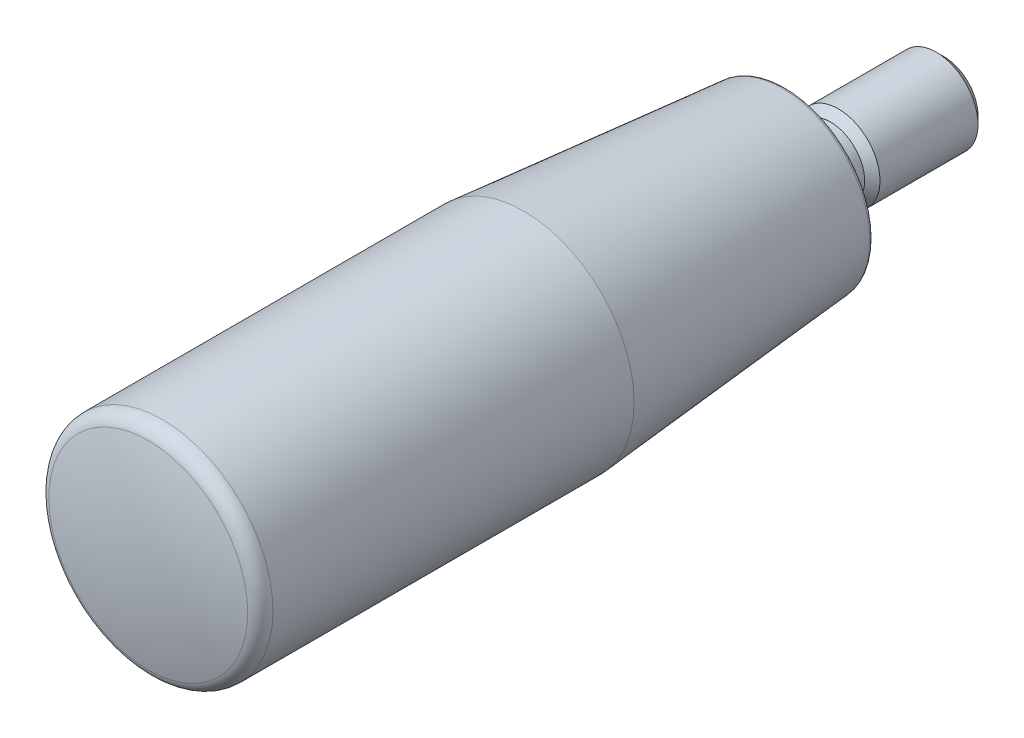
ISO-10303-21;
HEADER;
FILE_DESCRIPTION(('STEP AP214'),'2;1');
FILE_NAME('part.step','',(''),(''),'','','');
FILE_SCHEMA(('AUTOMOTIVE_DESIGN { 1 0 10303 214 1 1 1 1 }'));
ENDSEC;
DATA;
#1=APPLICATION_CONTEXT('core data for automotive mechanical design processes');
#2=APPLICATION_PROTOCOL_DEFINITION('international standard','automotive_design',2000,#1);
#3=PRODUCT_CONTEXT('',#1,'mechanical');
#4=PRODUCT('Part','Part','',(#3));
#5=PRODUCT_RELATED_PRODUCT_CATEGORY('part','',(#4));
#6=PRODUCT_DEFINITION_FORMATION('','',#4);
#7=PRODUCT_DEFINITION_CONTEXT('part definition',#1,'design');
#8=PRODUCT_DEFINITION('design','',#6,#7);
#9=PRODUCT_DEFINITION_SHAPE('','',#8);
#10=(LENGTH_UNIT() NAMED_UNIT(*) SI_UNIT(.MILLI.,.METRE.));
#11=(NAMED_UNIT(*) PLANE_ANGLE_UNIT() SI_UNIT($,.RADIAN.));
#12=(NAMED_UNIT(*) SI_UNIT($,.STERADIAN.) SOLID_ANGLE_UNIT());
#13=UNCERTAINTY_MEASURE_WITH_UNIT(LENGTH_MEASURE(1.E-05),#10,'distance_accuracy_value','');
#14=(GEOMETRIC_REPRESENTATION_CONTEXT(3) GLOBAL_UNCERTAINTY_ASSIGNED_CONTEXT((#13)) GLOBAL_UNIT_ASSIGNED_CONTEXT((#10,
#11,#12)) REPRESENTATION_CONTEXT('',''));
#15=CARTESIAN_POINT('',(0.,0.,0.));
#16=DIRECTION('',(0.,0.,1.));
#17=DIRECTION('',(1.,0.,0.));
#18=AXIS2_PLACEMENT_3D('',#15,#16,#17);
#19=CARTESIAN_POINT('',(0.,0.,-17.));
#20=DIRECTION('',(0.,0.,1.));
#21=DIRECTION('',(1.,0.,0.));
#22=AXIS2_PLACEMENT_3D('',#19,#20,#21);
#23=PLANE('',#22);
#24=CARTESIAN_POINT('',(0.,0.,-17.));
#25=DIRECTION('',(0.,0.,1.));
#26=DIRECTION('',(1.,0.,0.));
#27=AXIS2_PLACEMENT_3D('',#24,#25,#26);
#28=CIRCLE('',#27,4.08);
#29=CARTESIAN_POINT('',(4.08,0.,-17.));
#30=VERTEX_POINT('',#29);
#31=EDGE_CURVE('E130',#30,#30,#28,.T.);
#32=ORIENTED_EDGE('',*,*,#31,.F.);
#33=EDGE_LOOP('',(#32));
#34=FACE_BOUND('',#33,.T.);
#35=DIRECTION('',(-0.866025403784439,-0.5,0.));
#36=VECTOR('',#35,1.);
#37=CARTESIAN_POINT('',(1.25,-2.1650635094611,-17.));
#38=LINE('',#37,#36);
#39=CARTESIAN_POINT('',(2.5,-1.44337567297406,-17.));
#40=VERTEX_POINT('',#39);
#41=CARTESIAN_POINT('',(0.,-2.88675134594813,-17.));
#42=VERTEX_POINT('',#41);
#43=EDGE_CURVE('E9',#40,#42,#38,.T.);
#44=ORIENTED_EDGE('',*,*,#43,.F.);
#45=DIRECTION('',(0.,-1.,0.));
#46=VECTOR('',#45,1.);
#47=CARTESIAN_POINT('',(2.5,0.,-17.));
#48=LINE('',#47,#46);
#49=CARTESIAN_POINT('',(2.5,1.44337567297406,-17.));
#50=VERTEX_POINT('',#49);
#51=EDGE_CURVE('E78',#50,#40,#48,.T.);
#52=ORIENTED_EDGE('',*,*,#51,.F.);
#53=DIRECTION('',(0.866025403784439,-0.5,0.));
#54=VECTOR('',#53,1.);
#55=CARTESIAN_POINT('',(1.25,2.1650635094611,-17.));
#56=LINE('',#55,#54);
#57=CARTESIAN_POINT('',(0.,2.88675134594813,-17.));
#58=VERTEX_POINT('',#57);
#59=EDGE_CURVE('E134',#58,#50,#56,.T.);
#60=ORIENTED_EDGE('',*,*,#59,.F.);
#61=DIRECTION('',(0.866025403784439,0.5,0.));
#62=VECTOR('',#61,1.);
#63=CARTESIAN_POINT('',(-1.25,2.1650635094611,-17.));
#64=LINE('',#63,#62);
#65=CARTESIAN_POINT('',(-2.5,1.44337567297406,-17.));
#66=VERTEX_POINT('',#65);
#67=EDGE_CURVE('E136',#66,#58,#64,.T.);
#68=ORIENTED_EDGE('',*,*,#67,.F.);
#69=DIRECTION('',(0.,1.,0.));
#70=VECTOR('',#69,1.);
#71=CARTESIAN_POINT('',(-2.5,0.,-17.));
#72=LINE('',#71,#70);
#73=CARTESIAN_POINT('',(-2.5,-1.44337567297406,-17.));
#74=VERTEX_POINT('',#73);
#75=EDGE_CURVE('E138',#74,#66,#72,.T.);
#76=ORIENTED_EDGE('',*,*,#75,.F.);
#77=DIRECTION('',(-0.866025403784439,0.5,0.));
#78=VECTOR('',#77,1.);
#79=CARTESIAN_POINT('',(-1.25,-2.1650635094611,-17.));
#80=LINE('',#79,#78);
#81=EDGE_CURVE('E21',#42,#74,#80,.T.);
#82=ORIENTED_EDGE('',*,*,#81,.F.);
#83=EDGE_LOOP('',(#44,#52,#60,#68,#76,#82));
#84=FACE_BOUND('',#83,.T.);
#85=ADVANCED_FACE('F14',(#34,#84),#23,.F.);
#86=CARTESIAN_POINT('',(0.,0.,-17.));
#87=DIRECTION('',(0.,0.,1.));
#88=DIRECTION('',(1.,0.,0.));
#89=AXIS2_PLACEMENT_3D('',#86,#87,#88);
#90=CONICAL_SURFACE('',#89,4.08,0.785398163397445);
#91=CARTESIAN_POINT('',(0.,0.,-16.08));
#92=DIRECTION('',(0.,0.,1.));
#93=DIRECTION('',(1.,0.,0.));
#94=AXIS2_PLACEMENT_3D('',#91,#92,#93);
#95=CIRCLE('',#94,5.);
#96=CARTESIAN_POINT('',(5.,0.,-16.08));
#97=VERTEX_POINT('',#96);
#98=EDGE_CURVE('E127',#97,#97,#95,.T.);
#99=ORIENTED_EDGE('',*,*,#98,.F.);
#100=EDGE_LOOP('',(#99));
#101=FACE_BOUND('',#100,.T.);
#102=ORIENTED_EDGE('',*,*,#31,.T.);
#103=EDGE_LOOP('',(#102));
#104=FACE_BOUND('',#103,.T.);
#105=ADVANCED_FACE('F171',(#101,#104),#90,.T.);
#106=CARTESIAN_POINT('',(0.,0.,80.));
#107=DIRECTION('',(0.,0.,1.));
#108=DIRECTION('',(1.,0.,0.));
#109=AXIS2_PLACEMENT_3D('',#106,#107,#108);
#110=CYLINDRICAL_SURFACE('',#109,5.);
#111=CARTESIAN_POINT('',(0.,0.,-4.32));
#112=DIRECTION('',(0.,0.,1.));
#113=DIRECTION('',(1.,0.,0.));
#114=AXIS2_PLACEMENT_3D('',#111,#112,#113);
#115=CIRCLE('',#114,5.);
#116=CARTESIAN_POINT('',(5.,0.,-4.32));
#117=VERTEX_POINT('',#116);
#118=EDGE_CURVE('E124',#117,#117,#115,.T.);
#119=ORIENTED_EDGE('',*,*,#118,.F.);
#120=EDGE_LOOP('',(#119));
#121=FACE_BOUND('',#120,.T.);
#122=ORIENTED_EDGE('',*,*,#98,.T.);
#123=EDGE_LOOP('',(#122));
#124=FACE_BOUND('',#123,.T.);
#125=ADVANCED_FACE('F176',(#121,#124),#110,.T.);
#126=CARTESIAN_POINT('',(0.,0.,-4.32));
#127=DIRECTION('',(0.,0.,-1.));
#128=DIRECTION('',(-1.,0.,0.));
#129=AXIS2_PLACEMENT_3D('',#126,#127,#128);
#130=CONICAL_SURFACE('',#129,5.,0.785398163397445);
#131=CARTESIAN_POINT('',(0.,0.,-3.4));
#132=DIRECTION('',(0.,0.,1.));
#133=DIRECTION('',(1.,0.,0.));
#134=AXIS2_PLACEMENT_3D('',#131,#132,#133);
#135=CIRCLE('',#134,4.08);
#136=CARTESIAN_POINT('',(4.08,0.,-3.4));
#137=VERTEX_POINT('',#136);
#138=EDGE_CURVE('E121',#137,#137,#135,.T.);
#139=ORIENTED_EDGE('',*,*,#138,.F.);
#140=EDGE_LOOP('',(#139));
#141=FACE_BOUND('',#140,.T.);
#142=ORIENTED_EDGE('',*,*,#118,.T.);
#143=EDGE_LOOP('',(#142));
#144=FACE_BOUND('',#143,.T.);
#145=ADVANCED_FACE('F183',(#141,#144),#130,.T.);
#146=CARTESIAN_POINT('',(0.,0.,80.));
#147=DIRECTION('',(0.,0.,1.));
#148=DIRECTION('',(1.,0.,0.));
#149=AXIS2_PLACEMENT_3D('',#146,#147,#148);
#150=CYLINDRICAL_SURFACE('',#149,4.08);
#151=CARTESIAN_POINT('',(0.,0.,0.));
#152=DIRECTION('',(0.,0.,1.));
#153=DIRECTION('',(1.,0.,0.));
#154=AXIS2_PLACEMENT_3D('',#151,#152,#153);
#155=CIRCLE('',#154,4.08);
#156=CARTESIAN_POINT('',(4.08,0.,0.));
#157=VERTEX_POINT('',#156);
#158=EDGE_CURVE('E118',#157,#157,#155,.T.);
#159=ORIENTED_EDGE('',*,*,#158,.F.);
#160=EDGE_LOOP('',(#159));
#161=FACE_BOUND('',#160,.T.);
#162=ORIENTED_EDGE('',*,*,#138,.T.);
#163=EDGE_LOOP('',(#162));
#164=FACE_BOUND('',#163,.T.);
#165=ADVANCED_FACE('F190',(#161,#164),#150,.T.);
#166=CARTESIAN_POINT('',(0.,4.08,0.));
#167=DIRECTION('',(0.,0.,1.));
#168=DIRECTION('',(1.,0.,0.));
#169=AXIS2_PLACEMENT_3D('',#166,#167,#168);
#170=PLANE('',#169);
#171=CARTESIAN_POINT('',(0.,0.,0.));
#172=DIRECTION('',(0.,0.,1.));
#173=DIRECTION('',(1.,0.,0.));
#174=AXIS2_PLACEMENT_3D('',#171,#172,#173);
#175=CIRCLE('',#174,6.);
#176=CARTESIAN_POINT('',(6.,0.,0.));
#177=VERTEX_POINT('',#176);
#178=EDGE_CURVE('E115',#177,#177,#175,.T.);
#179=ORIENTED_EDGE('',*,*,#178,.F.);
#180=EDGE_LOOP('',(#179));
#181=FACE_BOUND('',#180,.T.);
#182=ORIENTED_EDGE('',*,*,#158,.T.);
#183=EDGE_LOOP('',(#182));
#184=FACE_BOUND('',#183,.T.);
#185=ADVANCED_FACE('F194',(#181,#184),#170,.F.);
#186=CARTESIAN_POINT('',(0.,0.,80.));
#187=DIRECTION('',(0.,0.,1.));
#188=DIRECTION('',(1.,0.,0.));
#189=AXIS2_PLACEMENT_3D('',#186,#187,#188);
#190=CYLINDRICAL_SURFACE('',#189,6.);
#191=CARTESIAN_POINT('',(0.,0.,2.));
#192=DIRECTION('',(0.,0.,1.));
#193=DIRECTION('',(1.,0.,0.));
#194=AXIS2_PLACEMENT_3D('',#191,#192,#193);
#195=CIRCLE('',#194,6.);
#196=CARTESIAN_POINT('',(6.,0.,2.));
#197=VERTEX_POINT('',#196);
#198=EDGE_CURVE('E112',#197,#197,#195,.T.);
#199=ORIENTED_EDGE('',*,*,#198,.F.);
#200=EDGE_LOOP('',(#199));
#201=FACE_BOUND('',#200,.T.);
#202=ORIENTED_EDGE('',*,*,#178,.T.);
#203=EDGE_LOOP('',(#202));
#204=FACE_BOUND('',#203,.T.);
#205=ADVANCED_FACE('F198',(#201,#204),#190,.T.);
#206=CARTESIAN_POINT('',(0.,6.,2.));
#207=DIRECTION('',(0.,0.,1.));
#208=DIRECTION('',(1.,0.,0.));
#209=AXIS2_PLACEMENT_3D('',#206,#207,#208);
#210=PLANE('',#209);
#211=CARTESIAN_POINT('',(0.,0.,2.));
#212=DIRECTION('',(0.,0.,1.));
#213=DIRECTION('',(1.,0.,0.));
#214=AXIS2_PLACEMENT_3D('',#211,#212,#213);
#215=CIRCLE('',#214,10.0418344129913);
#216=CARTESIAN_POINT('',(10.0418344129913,0.,2.));
#217=VERTEX_POINT('',#216);
#218=EDGE_CURVE('E109',#217,#217,#215,.T.);
#219=ORIENTED_EDGE('',*,*,#218,.F.);
#220=EDGE_LOOP('',(#219));
#221=FACE_BOUND('',#220,.T.);
#222=ORIENTED_EDGE('',*,*,#198,.T.);
#223=EDGE_LOOP('',(#222));
#224=FACE_BOUND('',#223,.T.);
#225=ADVANCED_FACE('F202',(#221,#224),#210,.F.);
#226=CARTESIAN_POINT('',(0.,0.,2.5));
#227=DIRECTION('',(0.,0.,1.));
#228=DIRECTION('',(1.,0.,0.));
#229=AXIS2_PLACEMENT_3D('',#226,#227,#228);
#230=TOROIDAL_SURFACE('',#229,10.0418344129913,0.5);
#231=ORIENTED_EDGE('',*,*,#218,.T.);
#232=EDGE_LOOP('',(#231));
#233=FACE_BOUND('',#232,.T.);
#234=CARTESIAN_POINT('',(0.,0.,2.45642212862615));
#235=DIRECTION('',(0.,0.,1.));
#236=DIRECTION('',(1.,0.,0.));
#237=AXIS2_PLACEMENT_3D('',#234,#235,#236);
#238=CIRCLE('',#237,10.5399317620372);
#239=CARTESIAN_POINT('',(10.5399317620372,0.,2.45642212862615));
#240=VERTEX_POINT('',#239);
#241=EDGE_CURVE('E106',#240,#240,#238,.T.);
#242=ORIENTED_EDGE('',*,*,#241,.F.);
#243=EDGE_LOOP('',(#242));
#244=FACE_BOUND('',#243,.T.);
#245=ADVANCED_FACE('F206',(#233,#244),#230,.T.);
#246=CARTESIAN_POINT('',(0.,0.,2.45642212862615));
#247=DIRECTION('',(0.,0.,1.));
#248=DIRECTION('',(1.,0.,0.));
#249=AXIS2_PLACEMENT_3D('',#246,#247,#248);
#250=CONICAL_SURFACE('',#249,10.5399317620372,0.0872664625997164);
#251=CARTESIAN_POINT('',(0.,0.,33.4326438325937));
#252=DIRECTION('',(0.,0.,1.));
#253=DIRECTION('',(1.,0.,0.));
#254=AXIS2_PLACEMENT_3D('',#251,#252,#253);
#255=CIRCLE('',#254,13.25);
#256=CARTESIAN_POINT('',(13.25,0.,33.4326438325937));
#257=VERTEX_POINT('',#256);
#258=EDGE_CURVE('E103',#257,#257,#255,.T.);
#259=ORIENTED_EDGE('',*,*,#258,.F.);
#260=EDGE_LOOP('',(#259));
#261=FACE_BOUND('',#260,.T.);
#262=ORIENTED_EDGE('',*,*,#241,.T.);
#263=EDGE_LOOP('',(#262));
#264=FACE_BOUND('',#263,.T.);
#265=ADVANCED_FACE('F210',(#261,#264),#250,.T.);
#266=CARTESIAN_POINT('',(0.,0.,80.));
#267=DIRECTION('',(0.,0.,1.));
#268=DIRECTION('',(1.,0.,0.));
#269=AXIS2_PLACEMENT_3D('',#266,#267,#268);
#270=CYLINDRICAL_SURFACE('',#269,13.25);
#271=CARTESIAN_POINT('',(0.,0.,76.7622349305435));
#272=DIRECTION('',(0.,0.,1.));
#273=DIRECTION('',(1.,0.,0.));
#274=AXIS2_PLACEMENT_3D('',#271,#272,#273);
#275=CIRCLE('',#274,13.25);
#276=CARTESIAN_POINT('',(13.25,0.,76.7622349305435));
#277=VERTEX_POINT('',#276);
#278=EDGE_CURVE('E100',#277,#277,#275,.T.);
#279=ORIENTED_EDGE('',*,*,#278,.F.);
#280=EDGE_LOOP('',(#279));
#281=FACE_BOUND('',#280,.T.);
#282=ORIENTED_EDGE('',*,*,#258,.T.);
#283=EDGE_LOOP('',(#282));
#284=FACE_BOUND('',#283,.T.);
#285=ADVANCED_FACE('F214',(#281,#284),#270,.T.);
#286=CARTESIAN_POINT('',(0.,0.,76.7622349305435));
#287=DIRECTION('',(0.,0.,1.));
#288=DIRECTION('',(1.,0.,0.));
#289=AXIS2_PLACEMENT_3D('',#286,#287,#288);
#290=TOROIDAL_SURFACE('',#289,11.4833333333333,1.76666666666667);
#291=ORIENTED_EDGE('',*,*,#278,.T.);
#292=EDGE_LOOP('',(#291));
#293=FACE_BOUND('',#292,.T.);
#294=CARTESIAN_POINT('',(0.,0.,78.4718507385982));
#295=DIRECTION('',(0.,0.,1.));
#296=DIRECTION('',(1.,0.,0.));
#297=AXIS2_PLACEMENT_3D('',#294,#295,#296);
#298=CIRCLE('',#297,11.9286701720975);
#299=CARTESIAN_POINT('',(11.9286701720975,0.,78.4718507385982));
#300=VERTEX_POINT('',#299);
#301=EDGE_CURVE('E97',#300,#300,#298,.T.);
#302=ORIENTED_EDGE('',*,*,#301,.F.);
#303=EDGE_LOOP('',(#302));
#304=FACE_BOUND('',#303,.T.);
#305=ADVANCED_FACE('F218',(#293,#304),#290,.T.);
#306=CARTESIAN_POINT('',(0.,1.16226472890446E-13,32.678571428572));
#307=DIRECTION('',(0.,0.,1.));
#308=DIRECTION('',(0.,-1.,0.));
#309=AXIS2_PLACEMENT_3D('',#306,#307,#308);
#310=SPHERICAL_SURFACE('',#309,47.321428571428);
#311=ORIENTED_EDGE('',*,*,#301,.T.);
#312=EDGE_LOOP('',(#311));
#313=FACE_BOUND('',#312,.T.);
#314=ADVANCED_FACE('F222',(#313),#310,.T.);
#315=CARTESIAN_POINT('',(2.5,-1.44337567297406,-22.));
#316=DIRECTION('',(-0.5,0.866025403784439,0.));
#317=DIRECTION('',(-0.866025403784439,-0.5,0.));
#318=AXIS2_PLACEMENT_3D('',#315,#316,#317);
#319=PLANE('',#318);
#320=ORIENTED_EDGE('',*,*,#43,.T.);
#321=DIRECTION('',(0.,0.,1.));
#322=VECTOR('',#321,1.);
#323=CARTESIAN_POINT('',(0.,-2.88675134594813,-22.));
#324=LINE('',#323,#322);
#325=CARTESIAN_POINT('',(0.,-2.88675134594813,-12.));
#326=VERTEX_POINT('',#325);
#327=EDGE_CURVE('E67',#42,#326,#324,.T.);
#328=ORIENTED_EDGE('',*,*,#327,.T.);
#329=DIRECTION('',(-0.866025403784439,-0.5,0.));
#330=VECTOR('',#329,1.);
#331=CARTESIAN_POINT('',(2.5,-1.44337567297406,-12.));
#332=LINE('',#331,#330);
#333=CARTESIAN_POINT('',(2.5,-1.44337567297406,-12.));
#334=VERTEX_POINT('',#333);
#335=EDGE_CURVE('E63',#334,#326,#332,.T.);
#336=ORIENTED_EDGE('',*,*,#335,.F.);
#337=DIRECTION('',(0.,0.,1.));
#338=VECTOR('',#337,1.);
#339=CARTESIAN_POINT('',(2.5,-1.44337567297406,-22.));
#340=LINE('',#339,#338);
#341=EDGE_CURVE('E66',#40,#334,#340,.T.);
#342=ORIENTED_EDGE('',*,*,#341,.F.);
#343=EDGE_LOOP('',(#320,#328,#336,#342));
#344=FACE_BOUND('',#343,.T.);
#345=ADVANCED_FACE('F65',(#344),#319,.T.);
#346=CARTESIAN_POINT('',(0.,-2.88675134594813,-22.));
#347=DIRECTION('',(0.5,0.866025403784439,0.));
#348=DIRECTION('',(-0.866025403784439,0.5,0.));
#349=AXIS2_PLACEMENT_3D('',#346,#347,#348);
#350=PLANE('',#349);
#351=ORIENTED_EDGE('',*,*,#81,.T.);
#352=DIRECTION('',(0.,0.,1.));
#353=VECTOR('',#352,1.);
#354=CARTESIAN_POINT('',(-2.5,-1.44337567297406,-22.));
#355=LINE('',#354,#353);
#356=CARTESIAN_POINT('',(-2.5,-1.44337567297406,-12.));
#357=VERTEX_POINT('',#356);
#358=EDGE_CURVE('E94',#74,#357,#355,.T.);
#359=ORIENTED_EDGE('',*,*,#358,.T.);
#360=DIRECTION('',(-0.866025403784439,0.5,0.));
#361=VECTOR('',#360,1.);
#362=CARTESIAN_POINT('',(0.,-2.88675134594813,-12.));
#363=LINE('',#362,#361);
#364=EDGE_CURVE('E72',#326,#357,#363,.T.);
#365=ORIENTED_EDGE('',*,*,#364,.F.);
#366=ORIENTED_EDGE('',*,*,#327,.F.);
#367=EDGE_LOOP('',(#351,#359,#365,#366));
#368=FACE_BOUND('',#367,.T.);
#369=ADVANCED_FACE('F142',(#368),#350,.T.);
#370=CARTESIAN_POINT('',(-2.5,-1.44337567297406,-22.));
#371=DIRECTION('',(1.,0.,0.));
#372=DIRECTION('',(0.,0.,-1.));
#373=AXIS2_PLACEMENT_3D('',#370,#371,#372);
#374=PLANE('',#373);
#375=ORIENTED_EDGE('',*,*,#75,.T.);
#376=DIRECTION('',(0.,0.,1.));
#377=VECTOR('',#376,1.);
#378=CARTESIAN_POINT('',(-2.5,1.44337567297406,-22.));
#379=LINE('',#378,#377);
#380=CARTESIAN_POINT('',(-2.5,1.44337567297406,-12.));
#381=VERTEX_POINT('',#380);
#382=EDGE_CURVE('E92',#66,#381,#379,.T.);
#383=ORIENTED_EDGE('',*,*,#382,.T.);
#384=DIRECTION('',(0.,1.,0.));
#385=VECTOR('',#384,1.);
#386=CARTESIAN_POINT('',(-2.5,-1.44337567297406,-12.));
#387=LINE('',#386,#385);
#388=EDGE_CURVE('E150',#357,#381,#387,.T.);
#389=ORIENTED_EDGE('',*,*,#388,.F.);
#390=ORIENTED_EDGE('',*,*,#358,.F.);
#391=EDGE_LOOP('',(#375,#383,#389,#390));
#392=FACE_BOUND('',#391,.T.);
#393=ADVANCED_FACE('F147',(#392),#374,.T.);
#394=CARTESIAN_POINT('',(-2.5,1.44337567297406,-22.));
#395=DIRECTION('',(0.5,-0.866025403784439,0.));
#396=DIRECTION('',(0.866025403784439,0.5,0.));
#397=AXIS2_PLACEMENT_3D('',#394,#395,#396);
#398=PLANE('',#397);
#399=ORIENTED_EDGE('',*,*,#67,.T.);
#400=DIRECTION('',(0.,0.,1.));
#401=VECTOR('',#400,1.);
#402=CARTESIAN_POINT('',(0.,2.88675134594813,-22.));
#403=LINE('',#402,#401);
#404=CARTESIAN_POINT('',(0.,2.88675134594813,-12.));
#405=VERTEX_POINT('',#404);
#406=EDGE_CURVE('E90',#58,#405,#403,.T.);
#407=ORIENTED_EDGE('',*,*,#406,.T.);
#408=DIRECTION('',(0.866025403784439,0.5,0.));
#409=VECTOR('',#408,1.);
#410=CARTESIAN_POINT('',(-2.5,1.44337567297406,-12.));
#411=LINE('',#410,#409);
#412=EDGE_CURVE('E85',#381,#405,#411,.T.);
#413=ORIENTED_EDGE('',*,*,#412,.F.);
#414=ORIENTED_EDGE('',*,*,#382,.F.);
#415=EDGE_LOOP('',(#399,#407,#413,#414));
#416=FACE_BOUND('',#415,.T.);
#417=ADVANCED_FACE('F155',(#416),#398,.T.);
#418=CARTESIAN_POINT('',(0.,2.88675134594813,-22.));
#419=DIRECTION('',(-0.5,-0.866025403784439,0.));
#420=DIRECTION('',(0.866025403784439,-0.5,0.));
#421=AXIS2_PLACEMENT_3D('',#418,#419,#420);
#422=PLANE('',#421);
#423=ORIENTED_EDGE('',*,*,#59,.T.);
#424=DIRECTION('',(0.,0.,1.));
#425=VECTOR('',#424,1.);
#426=CARTESIAN_POINT('',(2.5,1.44337567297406,-22.));
#427=LINE('',#426,#425);
#428=CARTESIAN_POINT('',(2.5,1.44337567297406,-12.));
#429=VERTEX_POINT('',#428);
#430=EDGE_CURVE('E28',#50,#429,#427,.T.);
#431=ORIENTED_EDGE('',*,*,#430,.T.);
#432=DIRECTION('',(0.866025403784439,-0.5,0.));
#433=VECTOR('',#432,1.);
#434=CARTESIAN_POINT('',(0.,2.88675134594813,-12.));
#435=LINE('',#434,#433);
#436=EDGE_CURVE('E83',#405,#429,#435,.T.);
#437=ORIENTED_EDGE('',*,*,#436,.F.);
#438=ORIENTED_EDGE('',*,*,#406,.F.);
#439=EDGE_LOOP('',(#423,#431,#437,#438));
#440=FACE_BOUND('',#439,.T.);
#441=ADVANCED_FACE('F158',(#440),#422,.T.);
#442=CARTESIAN_POINT('',(2.5,1.44337567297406,-22.));
#443=DIRECTION('',(-1.,0.,0.));
#444=DIRECTION('',(0.,0.,1.));
#445=AXIS2_PLACEMENT_3D('',#442,#443,#444);
#446=PLANE('',#445);
#447=ORIENTED_EDGE('',*,*,#51,.T.);
#448=ORIENTED_EDGE('',*,*,#341,.T.);
#449=DIRECTION('',(0.,-1.,0.));
#450=VECTOR('',#449,1.);
#451=CARTESIAN_POINT('',(2.5,1.44337567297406,-12.));
#452=LINE('',#451,#450);
#453=EDGE_CURVE('E75',#429,#334,#452,.T.);
#454=ORIENTED_EDGE('',*,*,#453,.F.);
#455=ORIENTED_EDGE('',*,*,#430,.F.);
#456=EDGE_LOOP('',(#447,#448,#454,#455));
#457=FACE_BOUND('',#456,.T.);
#458=ADVANCED_FACE('F74',(#457),#446,.T.);
#459=CARTESIAN_POINT('',(0.,0.,-12.));
#460=DIRECTION('',(0.,0.,-1.));
#461=DIRECTION('',(-1.,0.,0.));
#462=AXIS2_PLACEMENT_3D('',#459,#460,#461);
#463=PLANE('',#462);
#464=ORIENTED_EDGE('',*,*,#453,.T.);
#465=ORIENTED_EDGE('',*,*,#335,.T.);
#466=ORIENTED_EDGE('',*,*,#364,.T.);
#467=ORIENTED_EDGE('',*,*,#388,.T.);
#468=ORIENTED_EDGE('',*,*,#412,.T.);
#469=ORIENTED_EDGE('',*,*,#436,.T.);
#470=EDGE_LOOP('',(#464,#465,#466,#467,#468,#469));
#471=FACE_BOUND('',#470,.T.);
#472=ADVANCED_FACE('F80',(#471),#463,.T.);
#473=CLOSED_SHELL('',(#85,#105,#125,#145,#165,#185,#205,#225,#245,#265,#285,#305,#314,#345,#369,
#393,#417,#441,#458,#472));
#474=MANIFOLD_SOLID_BREP('B1',#473);
#475=ADVANCED_BREP_SHAPE_REPRESENTATION('',(#18,#474),#14);
#476=SHAPE_DEFINITION_REPRESENTATION(#9,#475);
ENDSEC;
END-ISO-10303-21;
